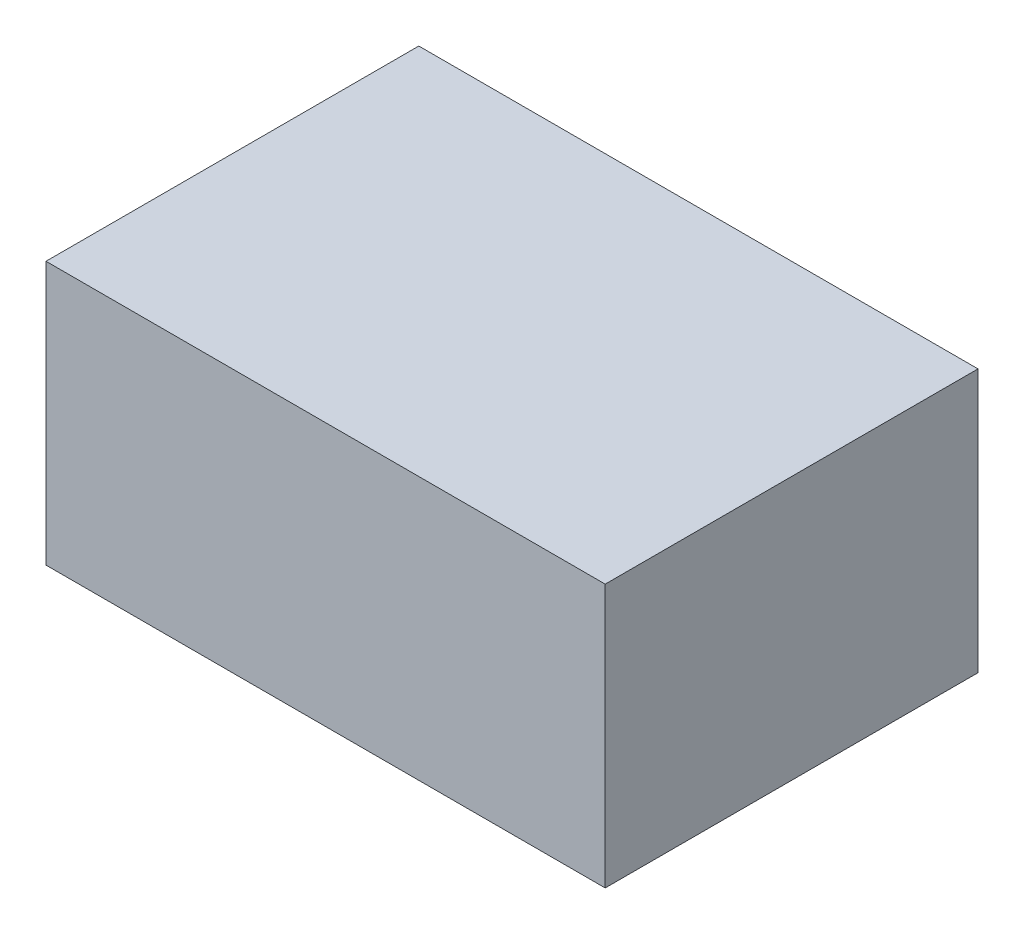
ISO-10303-21;
HEADER;
FILE_DESCRIPTION(('STEP AP214'),'2;1');
FILE_NAME('part.step','',(''),(''),'','','');
FILE_SCHEMA(('AUTOMOTIVE_DESIGN { 1 0 10303 214 1 1 1 1 }'));
ENDSEC;
DATA;
#1=APPLICATION_CONTEXT('core data for automotive mechanical design processes');
#2=APPLICATION_PROTOCOL_DEFINITION('international standard','automotive_design',2000,#1);
#3=PRODUCT_CONTEXT('',#1,'mechanical');
#4=PRODUCT('Part','Part','',(#3));
#5=PRODUCT_RELATED_PRODUCT_CATEGORY('part','',(#4));
#6=PRODUCT_DEFINITION_FORMATION('','',#4);
#7=PRODUCT_DEFINITION_CONTEXT('part definition',#1,'design');
#8=PRODUCT_DEFINITION('design','',#6,#7);
#9=PRODUCT_DEFINITION_SHAPE('','',#8);
#10=(LENGTH_UNIT() NAMED_UNIT(*) SI_UNIT(.MILLI.,.METRE.));
#11=(NAMED_UNIT(*) PLANE_ANGLE_UNIT() SI_UNIT($,.RADIAN.));
#12=(NAMED_UNIT(*) SI_UNIT($,.STERADIAN.) SOLID_ANGLE_UNIT());
#13=UNCERTAINTY_MEASURE_WITH_UNIT(LENGTH_MEASURE(1.E-05),#10,'distance_accuracy_value','');
#14=(GEOMETRIC_REPRESENTATION_CONTEXT(3) GLOBAL_UNCERTAINTY_ASSIGNED_CONTEXT((#13)) GLOBAL_UNIT_ASSIGNED_CONTEXT((#10,
#11,#12)) REPRESENTATION_CONTEXT('',''));
#15=CARTESIAN_POINT('',(0.,0.,0.));
#16=DIRECTION('',(0.,0.,1.));
#17=DIRECTION('',(1.,0.,0.));
#18=AXIS2_PLACEMENT_3D('',#15,#16,#17);
#19=CARTESIAN_POINT('',(-50.0115401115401,130.594047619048,170.));
#20=DIRECTION('',(1.,0.,0.));
#21=DIRECTION('',(0.,1.,0.));
#22=AXIS2_PLACEMENT_3D('',#19,#20,#21);
#23=PLANE('',#22);
#24=DIRECTION('',(0.,-1.,0.));
#25=VECTOR('',#24,1.);
#26=CARTESIAN_POINT('',(-50.0115401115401,130.594047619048,0.));
#27=LINE('',#26,#25);
#28=CARTESIAN_POINT('',(-50.0115401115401,130.594047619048,0.));
#29=VERTEX_POINT('',#28);
#30=CARTESIAN_POINT('',(-50.0115401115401,10.5940476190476,0.));
#31=VERTEX_POINT('',#30);
#32=EDGE_CURVE('E94',#29,#31,#27,.T.);
#33=ORIENTED_EDGE('',*,*,#32,.T.);
#34=DIRECTION('',(0.,0.,-1.));
#35=VECTOR('',#34,1.);
#36=CARTESIAN_POINT('',(-50.0115401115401,10.5940476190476,170.));
#37=LINE('',#36,#35);
#38=CARTESIAN_POINT('',(-50.0115401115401,10.5940476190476,170.));
#39=VERTEX_POINT('',#38);
#40=EDGE_CURVE('E11',#39,#31,#37,.T.);
#41=ORIENTED_EDGE('',*,*,#40,.F.);
#42=DIRECTION('',(0.,-1.,0.));
#43=VECTOR('',#42,1.);
#44=CARTESIAN_POINT('',(-50.0115401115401,130.594047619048,170.));
#45=LINE('',#44,#43);
#46=CARTESIAN_POINT('',(-50.0115401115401,130.594047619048,170.));
#47=VERTEX_POINT('',#46);
#48=EDGE_CURVE('E82',#47,#39,#45,.T.);
#49=ORIENTED_EDGE('',*,*,#48,.F.);
#50=DIRECTION('',(0.,0.,-1.));
#51=VECTOR('',#50,1.);
#52=CARTESIAN_POINT('',(-50.0115401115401,130.594047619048,170.));
#53=LINE('',#52,#51);
#54=EDGE_CURVE('E90',#47,#29,#53,.T.);
#55=ORIENTED_EDGE('',*,*,#54,.T.);
#56=EDGE_LOOP('',(#33,#41,#49,#55));
#57=FACE_BOUND('',#56,.T.);
#58=ADVANCED_FACE('F31',(#57),#23,.F.);
#59=CARTESIAN_POINT('',(-50.0115401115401,10.5940476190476,170.));
#60=DIRECTION('',(0.,1.,0.));
#61=DIRECTION('',(0.,0.,1.));
#62=AXIS2_PLACEMENT_3D('',#59,#60,#61);
#63=PLANE('',#62);
#64=DIRECTION('',(1.,0.,0.));
#65=VECTOR('',#64,1.);
#66=CARTESIAN_POINT('',(-50.0115401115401,10.5940476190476,0.));
#67=LINE('',#66,#65);
#68=CARTESIAN_POINT('',(204.98845988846,10.5940476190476,0.));
#69=VERTEX_POINT('',#68);
#70=EDGE_CURVE('E86',#31,#69,#67,.T.);
#71=ORIENTED_EDGE('',*,*,#70,.T.);
#72=DIRECTION('',(0.,0.,-1.));
#73=VECTOR('',#72,1.);
#74=CARTESIAN_POINT('',(204.98845988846,10.5940476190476,170.));
#75=LINE('',#74,#73);
#76=CARTESIAN_POINT('',(204.98845988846,10.5940476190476,170.));
#77=VERTEX_POINT('',#76);
#78=EDGE_CURVE('E39',#77,#69,#75,.T.);
#79=ORIENTED_EDGE('',*,*,#78,.F.);
#80=DIRECTION('',(1.,0.,0.));
#81=VECTOR('',#80,1.);
#82=CARTESIAN_POINT('',(-50.0115401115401,10.5940476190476,170.));
#83=LINE('',#82,#81);
#84=EDGE_CURVE('E77',#39,#77,#83,.T.);
#85=ORIENTED_EDGE('',*,*,#84,.F.);
#86=ORIENTED_EDGE('',*,*,#40,.T.);
#87=EDGE_LOOP('',(#71,#79,#85,#86));
#88=FACE_BOUND('',#87,.T.);
#89=ADVANCED_FACE('F85',(#88),#63,.F.);
#90=CARTESIAN_POINT('',(204.98845988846,130.594047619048,170.));
#91=DIRECTION('',(-1.,0.,0.));
#92=DIRECTION('',(0.,-1.,0.));
#93=AXIS2_PLACEMENT_3D('',#90,#91,#92);
#94=PLANE('',#93);
#95=DIRECTION('',(0.,1.,0.));
#96=VECTOR('',#95,1.);
#97=CARTESIAN_POINT('',(204.98845988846,130.594047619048,0.));
#98=LINE('',#97,#96);
#99=CARTESIAN_POINT('',(204.98845988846,130.594047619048,0.));
#100=VERTEX_POINT('',#99);
#101=EDGE_CURVE('E64',#69,#100,#98,.T.);
#102=ORIENTED_EDGE('',*,*,#101,.T.);
#103=DIRECTION('',(0.,0.,-1.));
#104=VECTOR('',#103,1.);
#105=CARTESIAN_POINT('',(204.98845988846,130.594047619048,170.));
#106=LINE('',#105,#104);
#107=CARTESIAN_POINT('',(204.98845988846,130.594047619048,170.));
#108=VERTEX_POINT('',#107);
#109=EDGE_CURVE('E87',#108,#100,#106,.T.);
#110=ORIENTED_EDGE('',*,*,#109,.F.);
#111=DIRECTION('',(0.,1.,0.));
#112=VECTOR('',#111,1.);
#113=CARTESIAN_POINT('',(204.98845988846,130.594047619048,170.));
#114=LINE('',#113,#112);
#115=EDGE_CURVE('E80',#77,#108,#114,.T.);
#116=ORIENTED_EDGE('',*,*,#115,.F.);
#117=ORIENTED_EDGE('',*,*,#78,.T.);
#118=EDGE_LOOP('',(#102,#110,#116,#117));
#119=FACE_BOUND('',#118,.T.);
#120=ADVANCED_FACE('F88',(#119),#94,.F.);
#121=CARTESIAN_POINT('',(-50.0115401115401,130.594047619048,170.));
#122=DIRECTION('',(0.,-1.,0.));
#123=DIRECTION('',(0.,0.,-1.));
#124=AXIS2_PLACEMENT_3D('',#121,#122,#123);
#125=PLANE('',#124);
#126=DIRECTION('',(-1.,0.,0.));
#127=VECTOR('',#126,1.);
#128=CARTESIAN_POINT('',(-50.0115401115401,130.594047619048,0.));
#129=LINE('',#128,#127);
#130=EDGE_CURVE('E70',#100,#29,#129,.T.);
#131=ORIENTED_EDGE('',*,*,#130,.T.);
#132=ORIENTED_EDGE('',*,*,#54,.F.);
#133=DIRECTION('',(-1.,0.,0.));
#134=VECTOR('',#133,1.);
#135=CARTESIAN_POINT('',(-50.0115401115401,130.594047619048,170.));
#136=LINE('',#135,#134);
#137=EDGE_CURVE('E47',#108,#47,#136,.T.);
#138=ORIENTED_EDGE('',*,*,#137,.F.);
#139=ORIENTED_EDGE('',*,*,#109,.T.);
#140=EDGE_LOOP('',(#131,#132,#138,#139));
#141=FACE_BOUND('',#140,.T.);
#142=ADVANCED_FACE('F101',(#141),#125,.F.);
#143=CARTESIAN_POINT('',(-50.0115401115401,10.5940476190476,170.));
#144=DIRECTION('',(0.,0.,1.));
#145=DIRECTION('',(1.,0.,0.));
#146=AXIS2_PLACEMENT_3D('',#143,#144,#145);
#147=PLANE('',#146);
#148=ORIENTED_EDGE('',*,*,#48,.T.);
#149=ORIENTED_EDGE('',*,*,#84,.T.);
#150=ORIENTED_EDGE('',*,*,#115,.T.);
#151=ORIENTED_EDGE('',*,*,#137,.T.);
#152=EDGE_LOOP('',(#148,#149,#150,#151));
#153=FACE_BOUND('',#152,.T.);
#154=ADVANCED_FACE('F78',(#153),#147,.T.);
#155=CARTESIAN_POINT('',(-50.0115401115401,10.5940476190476,0.));
#156=DIRECTION('',(0.,0.,1.));
#157=DIRECTION('',(1.,0.,0.));
#158=AXIS2_PLACEMENT_3D('',#155,#156,#157);
#159=PLANE('',#158);
#160=ORIENTED_EDGE('',*,*,#32,.F.);
#161=ORIENTED_EDGE('',*,*,#130,.F.);
#162=ORIENTED_EDGE('',*,*,#101,.F.);
#163=ORIENTED_EDGE('',*,*,#70,.F.);
#164=EDGE_LOOP('',(#160,#161,#162,#163));
#165=FACE_BOUND('',#164,.T.);
#166=ADVANCED_FACE('F104',(#165),#159,.F.);
#167=CLOSED_SHELL('',(#58,#89,#120,#142,#154,#166));
#168=MANIFOLD_SOLID_BREP('B2',#167);
#169=ADVANCED_BREP_SHAPE_REPRESENTATION('',(#18,#168),#14);
#170=SHAPE_DEFINITION_REPRESENTATION(#9,#169);
ENDSEC;
END-ISO-10303-21;
